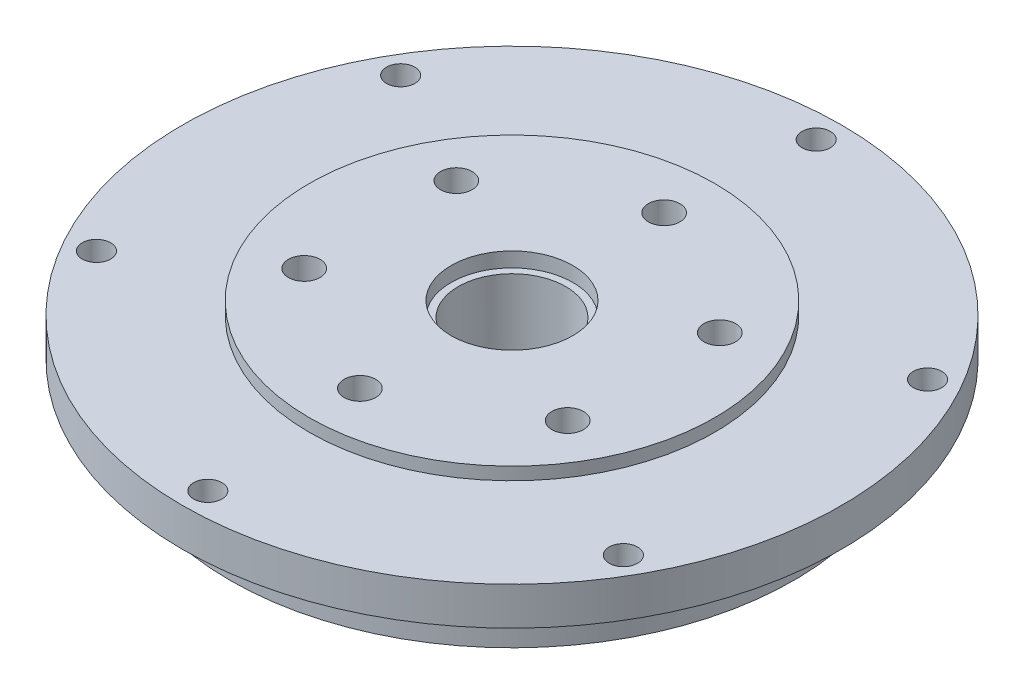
from build123d import *

# Parameters (mm, degrees)
SKETCH2_R          = 3.556
CUT_EXTRUDE1_DEPTH = 119.840042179
CIRPATTERN1_COUNT  = 6
SKETCH3_R          = 3.9624
CUT_EXTRUDE2_DEPTH = 19.05
CIRPATTERN2_COUNT  = 6
SKETCH4_R          = 3.9624
CUT_EXTRUDE3_DEPTH = 19.05
CIRPATTERN3_COUNT  = 6
SKETCH6_R          = 63.5635
CUT_EXTRUDE5_DEPTH = 3.175


with BuildPart() as part:
    # Sketch1 → Revolve1 (revolve)
    with BuildSketch(Plane.XY, mode=Mode.PRIVATE) as revolve1_sk:
        Polygon((13.462, 21.717), (15.24, 21.717), (15.24, 25.4), (50.8, 25.4), (50.8, 22.225), (82.55, 22.225), (82.55, 12.7), (70.612, 12.7), (70.612, 8.8138), (67.564, 8.8138), (67.564, 4.7498), (70.612, 4.7498), (70.612, 0), (13.462, 0), align=None)
    revolve(revolve1_sk.sketch.rotate(Axis((0, 77.365831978, 0), (0, -1, 0)), 90), axis=Axis((0, 77.365831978, 0), (0, -1, 0)))

    # Sketch2 → Cut-Extrude1 (cut, through all)
    with BuildSketch(Plane(origin=(0, 22.225, 0), x_dir=(-1, 0, 0), z_dir=(0, 1, 0))):
        with Locations(Location((0, -76.2, 0), (0, 0, 90))):
            Circle(SKETCH2_R)
    cut_extrude1 = extrude(amount=-CUT_EXTRUDE1_DEPTH, mode=Mode.SUBTRACT)

    # CirPattern1: Cut-Extrude1 ×6 about axis
    cirpattern1_axis = Axis((0, 0, 0), (0, 1, 0))
    for i in range(1, CIRPATTERN1_COUNT):
        add(cut_extrude1.rotate(cirpattern1_axis, i * 360 / CIRPATTERN1_COUNT), mode=Mode.SUBTRACT)

    # Sketch3 → Cut-Extrude2 (cut)
    with BuildSketch(Plane(origin=(0, 25.4, 0), x_dir=(-1, 0, 0), z_dir=(0, 1, 0))):
        with Locations(Location((0, -38.1, 0), (0, 0, 90))):
            Circle(SKETCH3_R)
    cut_extrude2 = extrude(amount=-CUT_EXTRUDE2_DEPTH, mode=Mode.SUBTRACT)

    # CirPattern2: Cut-Extrude2 ×6 about axis
    cirpattern2_axis = Axis((0, 0, 0), (0, 1, 0))
    for i in range(1, CIRPATTERN2_COUNT):
        add(cut_extrude2.rotate(cirpattern2_axis, i * 360 / CIRPATTERN2_COUNT), mode=Mode.SUBTRACT)

    # Sketch4 → Cut-Extrude3 (cut)
    with BuildSketch(Plane.XZ):
        with Locations(Location((57.15, 0, 0), (0, 0, 270))):
            Circle(SKETCH4_R)
    cut_extrude3 = extrude(amount=-CUT_EXTRUDE3_DEPTH, mode=Mode.SUBTRACT)

    # CirPattern3: Cut-Extrude3 ×6 about axis
    cirpattern3_axis = Axis((0, 0, 0), (0, 1, 0))
    for i in range(1, CIRPATTERN3_COUNT):
        add(cut_extrude3.rotate(cirpattern3_axis, i * 360 / CIRPATTERN3_COUNT), mode=Mode.SUBTRACT)

    # Sketch6 → Cut-Extrude5 (cut)
    with BuildSketch(Plane.XZ):
        with Locations(Location((0, 0, 0), (0, 0, 270))):
            Circle(SKETCH6_R)
    extrude(amount=-CUT_EXTRUDE5_DEPTH, mode=Mode.SUBTRACT)


solid = part.part
